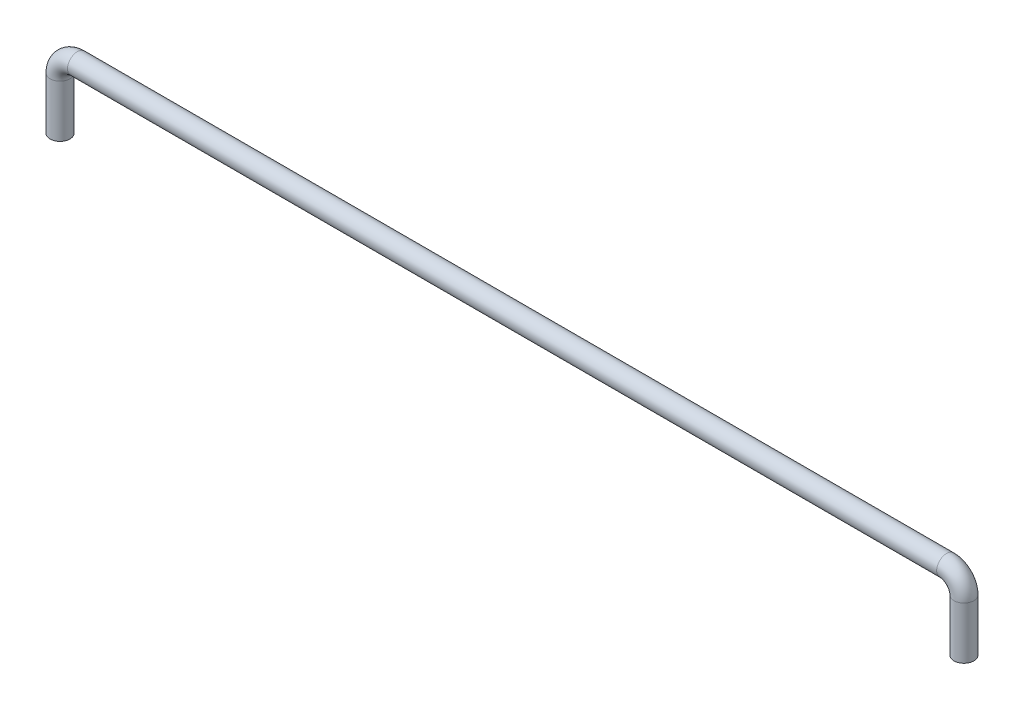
ISO-10303-21;
HEADER;
FILE_DESCRIPTION(('STEP AP214'),'2;1');
FILE_NAME('part.step','',(''),(''),'','','');
FILE_SCHEMA(('AUTOMOTIVE_DESIGN { 1 0 10303 214 1 1 1 1 }'));
ENDSEC;
DATA;
#1=APPLICATION_CONTEXT('core data for automotive mechanical design processes');
#2=APPLICATION_PROTOCOL_DEFINITION('international standard','automotive_design',2000,#1);
#3=PRODUCT_CONTEXT('',#1,'mechanical');
#4=PRODUCT('Part','Part','',(#3));
#5=PRODUCT_RELATED_PRODUCT_CATEGORY('part','',(#4));
#6=PRODUCT_DEFINITION_FORMATION('','',#4);
#7=PRODUCT_DEFINITION_CONTEXT('part definition',#1,'design');
#8=PRODUCT_DEFINITION('design','',#6,#7);
#9=PRODUCT_DEFINITION_SHAPE('','',#8);
#10=(LENGTH_UNIT() NAMED_UNIT(*) SI_UNIT(.MILLI.,.METRE.));
#11=(NAMED_UNIT(*) PLANE_ANGLE_UNIT() SI_UNIT($,.RADIAN.));
#12=(NAMED_UNIT(*) SI_UNIT($,.STERADIAN.) SOLID_ANGLE_UNIT());
#13=UNCERTAINTY_MEASURE_WITH_UNIT(LENGTH_MEASURE(1.E-05),#10,'distance_accuracy_value','');
#14=(GEOMETRIC_REPRESENTATION_CONTEXT(3) GLOBAL_UNCERTAINTY_ASSIGNED_CONTEXT((#13)) GLOBAL_UNIT_ASSIGNED_CONTEXT((#10,
#11,#12)) REPRESENTATION_CONTEXT('',''));
#15=CARTESIAN_POINT('',(0.,0.,0.));
#16=DIRECTION('',(0.,0.,1.));
#17=DIRECTION('',(1.,0.,0.));
#18=AXIS2_PLACEMENT_3D('',#15,#16,#17);
#19=CARTESIAN_POINT('',(132.08,0.,0.));
#20=DIRECTION('',(0.,-1.,0.));
#21=DIRECTION('',(0.,0.,1.));
#22=AXIS2_PLACEMENT_3D('',#19,#20,#21);
#23=PLANE('',#22);
#24=CARTESIAN_POINT('',(132.08,0.,0.));
#25=DIRECTION('',(0.,-1.,0.));
#26=DIRECTION('',(0.,0.,1.));
#27=AXIS2_PLACEMENT_3D('',#24,#25,#26);
#28=CIRCLE('',#27,1.45);
#29=CARTESIAN_POINT('',(132.08,0.,1.45));
#30=VERTEX_POINT('',#29);
#31=EDGE_CURVE('E68',#30,#30,#28,.T.);
#32=ORIENTED_EDGE('',*,*,#31,.T.);
#33=EDGE_LOOP('',(#32));
#34=FACE_BOUND('',#33,.T.);
#35=ADVANCED_FACE('F43',(#34),#23,.T.);
#36=CARTESIAN_POINT('',(0.,0.,0.));
#37=DIRECTION('',(0.,1.,0.));
#38=DIRECTION('',(0.,0.,1.));
#39=AXIS2_PLACEMENT_3D('',#36,#37,#38);
#40=PLANE('',#39);
#41=CARTESIAN_POINT('',(0.,0.,0.));
#42=DIRECTION('',(0.,1.,0.));
#43=DIRECTION('',(0.,0.,1.));
#44=AXIS2_PLACEMENT_3D('',#41,#42,#43);
#45=CIRCLE('',#44,1.45);
#46=CARTESIAN_POINT('',(0.,0.,1.45));
#47=VERTEX_POINT('',#46);
#48=EDGE_CURVE('E10',#47,#47,#45,.T.);
#49=ORIENTED_EDGE('',*,*,#48,.F.);
#50=EDGE_LOOP('',(#49));
#51=FACE_BOUND('',#50,.T.);
#52=ADVANCED_FACE('F80',(#51),#40,.F.);
#53=CARTESIAN_POINT('',(132.08,0.,0.));
#54=DIRECTION('',(0.,1.,0.));
#55=DIRECTION('',(0.,0.,1.));
#56=AXIS2_PLACEMENT_3D('',#53,#54,#55);
#57=CYLINDRICAL_SURFACE('',#56,1.45);
#58=CARTESIAN_POINT('',(132.08,7.62,0.));
#59=DIRECTION('',(0.,-1.,0.));
#60=DIRECTION('',(0.,0.,1.));
#61=AXIS2_PLACEMENT_3D('',#58,#59,#60);
#62=CIRCLE('',#61,1.45);
#63=CARTESIAN_POINT('',(133.53,7.62,0.));
#64=VERTEX_POINT('',#63);
#65=EDGE_CURVE('E67',#64,#64,#62,.T.);
#66=ORIENTED_EDGE('',*,*,#65,.T.);
#67=EDGE_LOOP('',(#66));
#68=FACE_BOUND('',#67,.T.);
#69=ORIENTED_EDGE('',*,*,#31,.F.);
#70=EDGE_LOOP('',(#69));
#71=FACE_BOUND('',#70,.T.);
#72=ADVANCED_FACE('F78',(#68,#71),#57,.T.);
#73=CARTESIAN_POINT('',(129.54,7.62,0.));
#74=DIRECTION('',(0.,0.,1.));
#75=DIRECTION('',(1.,0.,0.));
#76=AXIS2_PLACEMENT_3D('',#73,#74,#75);
#77=TOROIDAL_SURFACE('',#76,2.53999999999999,1.45);
#78=CARTESIAN_POINT('',(129.54,10.16,0.));
#79=DIRECTION('',(1.,0.,0.));
#80=DIRECTION('',(0.,0.,1.));
#81=AXIS2_PLACEMENT_3D('',#78,#79,#80);
#82=CIRCLE('',#81,1.45);
#83=CARTESIAN_POINT('',(129.54,11.61,0.));
#84=VERTEX_POINT('',#83);
#85=EDGE_CURVE('E58',#84,#84,#82,.T.);
#86=CARTESIAN_POINT('',(129.54,7.62,0.));
#87=DIRECTION('',(0.,0.,1.));
#88=DIRECTION('',(1.,0.,0.));
#89=AXIS2_PLACEMENT_3D('',#86,#87,#88);
#90=CIRCLE('',#89,3.98999999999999);
#91=EDGE_CURVE('',#64,#84,#90,.T.);
#92=ORIENTED_EDGE('',*,*,#65,.F.);
#93=ORIENTED_EDGE('',*,*,#85,.T.);
#94=ORIENTED_EDGE('',*,*,#91,.T.);
#95=ORIENTED_EDGE('',*,*,#91,.F.);
#96=EDGE_LOOP('',(#92,#94,#93,#95));
#97=FACE_BOUND('',#96,.T.);
#98=ADVANCED_FACE('F76',(#97),#77,.T.);
#99=CARTESIAN_POINT('',(129.54,10.16,0.));
#100=DIRECTION('',(-1.,0.,0.));
#101=DIRECTION('',(0.,-1.,0.));
#102=AXIS2_PLACEMENT_3D('',#99,#100,#101);
#103=CYLINDRICAL_SURFACE('',#102,1.45);
#104=CARTESIAN_POINT('',(2.54,10.16,0.));
#105=DIRECTION('',(1.,0.,0.));
#106=DIRECTION('',(0.,0.,1.));
#107=AXIS2_PLACEMENT_3D('',#104,#105,#106);
#108=CIRCLE('',#107,1.45);
#109=CARTESIAN_POINT('',(2.54,11.61,0.));
#110=VERTEX_POINT('',#109);
#111=EDGE_CURVE('E54',#110,#110,#108,.T.);
#112=ORIENTED_EDGE('',*,*,#111,.T.);
#113=EDGE_LOOP('',(#112));
#114=FACE_BOUND('',#113,.T.);
#115=ORIENTED_EDGE('',*,*,#85,.F.);
#116=EDGE_LOOP('',(#115));
#117=FACE_BOUND('',#116,.T.);
#118=ADVANCED_FACE('F86',(#114,#117),#103,.T.);
#119=CARTESIAN_POINT('',(2.54,7.62,0.));
#120=DIRECTION('',(0.,0.,1.));
#121=DIRECTION('',(1.,0.,0.));
#122=AXIS2_PLACEMENT_3D('',#119,#120,#121);
#123=TOROIDAL_SURFACE('',#122,2.54,1.45);
#124=CARTESIAN_POINT('',(0.,7.62,0.));
#125=DIRECTION('',(0.,1.,0.));
#126=DIRECTION('',(0.,0.,1.));
#127=AXIS2_PLACEMENT_3D('',#124,#125,#126);
#128=CIRCLE('',#127,1.45);
#129=CARTESIAN_POINT('',(-1.45,7.62,0.));
#130=VERTEX_POINT('',#129);
#131=EDGE_CURVE('E49',#130,#130,#128,.T.);
#132=CARTESIAN_POINT('',(2.54,7.62,0.));
#133=DIRECTION('',(0.,0.,1.));
#134=DIRECTION('',(1.,0.,0.));
#135=AXIS2_PLACEMENT_3D('',#132,#133,#134);
#136=CIRCLE('',#135,3.99);
#137=EDGE_CURVE('',#110,#130,#136,.T.);
#138=ORIENTED_EDGE('',*,*,#111,.F.);
#139=ORIENTED_EDGE('',*,*,#131,.T.);
#140=ORIENTED_EDGE('',*,*,#137,.T.);
#141=ORIENTED_EDGE('',*,*,#137,.F.);
#142=EDGE_LOOP('',(#138,#140,#139,#141));
#143=FACE_BOUND('',#142,.T.);
#144=ADVANCED_FACE('F95',(#143),#123,.T.);
#145=CARTESIAN_POINT('',(0.,7.62,0.));
#146=DIRECTION('',(0.,-1.,0.));
#147=DIRECTION('',(0.,0.,-1.));
#148=AXIS2_PLACEMENT_3D('',#145,#146,#147);
#149=CYLINDRICAL_SURFACE('',#148,1.45);
#150=ORIENTED_EDGE('',*,*,#48,.T.);
#151=EDGE_LOOP('',(#150));
#152=FACE_BOUND('',#151,.T.);
#153=ORIENTED_EDGE('',*,*,#131,.F.);
#154=EDGE_LOOP('',(#153));
#155=FACE_BOUND('',#154,.T.);
#156=ADVANCED_FACE('F89',(#152,#155),#149,.T.);
#157=CLOSED_SHELL('',(#35,#52,#72,#98,#118,#144,#156));
#158=MANIFOLD_SOLID_BREP('B2',#157);
#159=ADVANCED_BREP_SHAPE_REPRESENTATION('',(#18,#158),#14);
#160=SHAPE_DEFINITION_REPRESENTATION(#9,#159);
ENDSEC;
END-ISO-10303-21;
